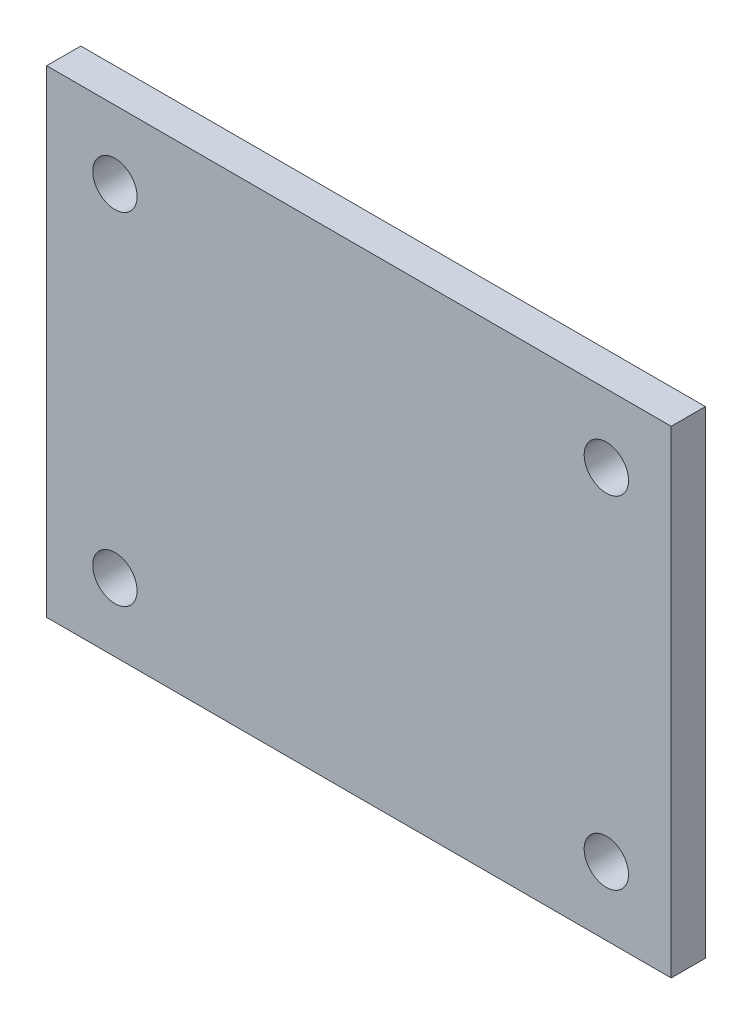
from build123d import *

# Parameters (mm, degrees)
ESQUISSE1_W                     = 183
ESQUISSE1_H                     = 140
EXTRUSION1_DEPTH                = 10
ESQUISSE2_R                     = 6.5
ENL_V_MAT_EXTRU_1_DEPTH         = 231.627405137
R_P_TITION_LIN_AIRE1_COUNT      = 2
R_P_TITION_LIN_AIRE1_PITCH      = 100
R_P_TITION_LIN_AIRE1_COUNT_DIR2 = 2
R_P_TITION_LIN_AIRE1_PITCH_DIR2 = 144


with BuildPart() as part:
    # Esquisse1 → Extrusion1 (new body)
    with BuildSketch(Plane.XY):
        with Locations((91.5, 70)):
            Rectangle(ESQUISSE1_W, ESQUISSE1_H)
    extrude(amount=EXTRUSION1_DEPTH)

    # Esquisse2 → Enl_v. mat.-Extru.1 (cut, through all)
    with BuildSketch(Plane.XY.offset(10)):
        with Locations((20, 20)):
            Circle(ESQUISSE2_R)
    enl_v_mat_extru_1 = extrude(amount=-ENL_V_MAT_EXTRU_1_DEPTH, mode=Mode.SUBTRACT)

    # R_p_tition lin_aire1: Enl_v. mat.-Extru.1 2 × 2
    with Locations(*[(j * R_P_TITION_LIN_AIRE1_PITCH_DIR2, i * R_P_TITION_LIN_AIRE1_PITCH, 0) for i in range(R_P_TITION_LIN_AIRE1_COUNT) for j in range(R_P_TITION_LIN_AIRE1_COUNT_DIR2) if (i, j) != (0, 0)]):
        add(enl_v_mat_extru_1, mode=Mode.SUBTRACT)


solid = part.part
